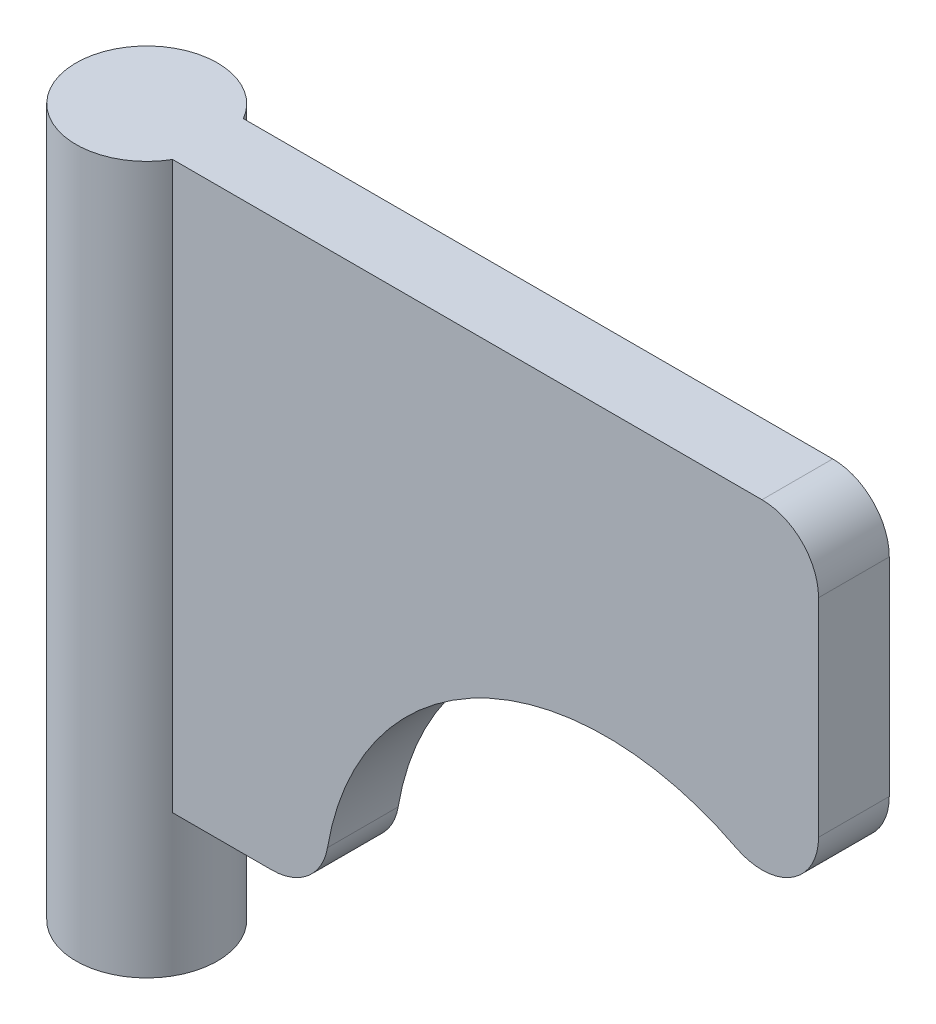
ISO-10303-21;
HEADER;
FILE_DESCRIPTION(('STEP AP214'),'2;1');
FILE_NAME('part.step','',(''),(''),'','','');
FILE_SCHEMA(('AUTOMOTIVE_DESIGN { 1 0 10303 214 1 1 1 1 }'));
ENDSEC;
DATA;
#1=APPLICATION_CONTEXT('core data for automotive mechanical design processes');
#2=APPLICATION_PROTOCOL_DEFINITION('international standard','automotive_design',2000,#1);
#3=PRODUCT_CONTEXT('',#1,'mechanical');
#4=PRODUCT('Part','Part','',(#3));
#5=PRODUCT_RELATED_PRODUCT_CATEGORY('part','',(#4));
#6=PRODUCT_DEFINITION_FORMATION('','',#4);
#7=PRODUCT_DEFINITION_CONTEXT('part definition',#1,'design');
#8=PRODUCT_DEFINITION('design','',#6,#7);
#9=PRODUCT_DEFINITION_SHAPE('','',#8);
#10=(LENGTH_UNIT() NAMED_UNIT(*) SI_UNIT(.MILLI.,.METRE.));
#11=(NAMED_UNIT(*) PLANE_ANGLE_UNIT() SI_UNIT($,.RADIAN.));
#12=(NAMED_UNIT(*) SI_UNIT($,.STERADIAN.) SOLID_ANGLE_UNIT());
#13=UNCERTAINTY_MEASURE_WITH_UNIT(LENGTH_MEASURE(1.E-05),#10,'distance_accuracy_value','');
#14=(GEOMETRIC_REPRESENTATION_CONTEXT(3) GLOBAL_UNCERTAINTY_ASSIGNED_CONTEXT((#13)) GLOBAL_UNIT_ASSIGNED_CONTEXT((#10,
#11,#12)) REPRESENTATION_CONTEXT('',''));
#15=CARTESIAN_POINT('',(0.,0.,0.));
#16=DIRECTION('',(0.,0.,1.));
#17=DIRECTION('',(1.,0.,0.));
#18=AXIS2_PLACEMENT_3D('',#15,#16,#17);
#19=CARTESIAN_POINT('',(0.,0.,3.175));
#20=DIRECTION('',(0.,1.,0.));
#21=DIRECTION('',(0.,0.,1.));
#22=AXIS2_PLACEMENT_3D('',#19,#20,#21);
#23=PLANE('',#22);
#24=DIRECTION('',(1.,0.,0.));
#25=VECTOR('',#24,1.);
#26=CARTESIAN_POINT('',(0.,0.,3.175));
#27=LINE('',#26,#25);
#28=CARTESIAN_POINT('',(2.74963065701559,0.,3.175));
#29=VERTEX_POINT('',#28);
#30=CARTESIAN_POINT('',(7.19815735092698,0.,3.175));
#31=VERTEX_POINT('',#30);
#32=EDGE_CURVE('E87',#29,#31,#27,.T.);
#33=ORIENTED_EDGE('',*,*,#32,.F.);
#34=CARTESIAN_POINT('',(0.,0.,1.5875));
#35=DIRECTION('',(0.,1.,0.));
#36=DIRECTION('',(0.,0.,1.));
#37=AXIS2_PLACEMENT_3D('',#34,#35,#36);
#38=CIRCLE('',#37,3.175);
#39=CARTESIAN_POINT('',(2.74963065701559,0.,0.));
#40=VERTEX_POINT('',#39);
#41=EDGE_CURVE('E161',#29,#40,#38,.T.);
#42=ORIENTED_EDGE('',*,*,#41,.T.);
#43=DIRECTION('',(1.,0.,0.));
#44=VECTOR('',#43,1.);
#45=CARTESIAN_POINT('',(0.,0.,0.));
#46=LINE('',#45,#44);
#47=CARTESIAN_POINT('',(7.19815735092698,0.,0.));
#48=VERTEX_POINT('',#47);
#49=EDGE_CURVE('E123',#40,#48,#46,.T.);
#50=ORIENTED_EDGE('',*,*,#49,.T.);
#51=DIRECTION('',(0.,0.,-1.));
#52=VECTOR('',#51,1.);
#53=CARTESIAN_POINT('',(7.19815735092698,0.,3.175));
#54=LINE('',#53,#52);
#55=EDGE_CURVE('E41',#31,#48,#54,.T.);
#56=ORIENTED_EDGE('',*,*,#55,.F.);
#57=EDGE_LOOP('',(#33,#42,#50,#56));
#58=FACE_BOUND('',#57,.T.);
#59=ADVANCED_FACE('F33',(#58),#23,.F.);
#60=CARTESIAN_POINT('',(7.19815735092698,2.54,3.175));
#61=DIRECTION('',(0.,0.,-1.));
#62=DIRECTION('',(-1.,0.,0.));
#63=AXIS2_PLACEMENT_3D('',#60,#61,#62);
#64=CYLINDRICAL_SURFACE('',#63,2.54);
#65=CARTESIAN_POINT('',(7.19815735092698,2.54,0.));
#66=DIRECTION('',(0.,0.,1.));
#67=DIRECTION('',(-1.,0.,0.));
#68=AXIS2_PLACEMENT_3D('',#65,#66,#67);
#69=CIRCLE('',#68,2.54);
#70=CARTESIAN_POINT('',(9.70263112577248,2.11666666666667,0.));
#71=VERTEX_POINT('',#70);
#72=EDGE_CURVE('E125',#48,#71,#69,.T.);
#73=ORIENTED_EDGE('',*,*,#72,.T.);
#74=DIRECTION('',(0.,0.,-1.));
#75=VECTOR('',#74,1.);
#76=CARTESIAN_POINT('',(9.70263112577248,2.11666666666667,3.175));
#77=LINE('',#76,#75);
#78=CARTESIAN_POINT('',(9.70263112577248,2.11666666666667,3.175));
#79=VERTEX_POINT('',#78);
#80=EDGE_CURVE('E139',#79,#71,#77,.T.);
#81=ORIENTED_EDGE('',*,*,#80,.F.);
#82=CARTESIAN_POINT('',(7.19815735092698,2.54,3.175));
#83=DIRECTION('',(0.,0.,1.));
#84=DIRECTION('',(-1.,0.,0.));
#85=AXIS2_PLACEMENT_3D('',#82,#83,#84);
#86=CIRCLE('',#85,2.54);
#87=EDGE_CURVE('E147',#31,#79,#86,.T.);
#88=ORIENTED_EDGE('',*,*,#87,.F.);
#89=ORIENTED_EDGE('',*,*,#55,.T.);
#90=EDGE_LOOP('',(#73,#81,#88,#89));
#91=FACE_BOUND('',#90,.T.);
#92=ADVANCED_FACE('F145',(#91),#64,.T.);
#93=CARTESIAN_POINT('',(22.225,0.,3.175));
#94=DIRECTION('',(0.,0.,-1.));
#95=DIRECTION('',(-1.,0.,0.));
#96=AXIS2_PLACEMENT_3D('',#93,#94,#95);
#97=CYLINDRICAL_SURFACE('',#96,12.7);
#98=CARTESIAN_POINT('',(22.225,0.,0.));
#99=DIRECTION('',(0.,0.,-1.));
#100=DIRECTION('',(1.,0.,0.));
#101=AXIS2_PLACEMENT_3D('',#98,#99,#100);
#102=CIRCLE('',#101,12.7);
#103=CARTESIAN_POINT('',(28.0458333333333,11.2875107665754,0.));
#104=VERTEX_POINT('',#103);
#105=EDGE_CURVE('E128',#71,#104,#102,.T.);
#106=ORIENTED_EDGE('',*,*,#105,.T.);
#107=DIRECTION('',(0.,0.,-1.));
#108=VECTOR('',#107,1.);
#109=CARTESIAN_POINT('',(28.0458333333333,11.2875107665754,3.175));
#110=LINE('',#109,#108);
#111=CARTESIAN_POINT('',(28.0458333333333,11.2875107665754,3.175));
#112=VERTEX_POINT('',#111);
#113=EDGE_CURVE('E112',#112,#104,#110,.T.);
#114=ORIENTED_EDGE('',*,*,#113,.F.);
#115=CARTESIAN_POINT('',(22.225,0.,3.175));
#116=DIRECTION('',(0.,0.,-1.));
#117=DIRECTION('',(1.,0.,0.));
#118=AXIS2_PLACEMENT_3D('',#115,#116,#117);
#119=CIRCLE('',#118,12.7);
#120=EDGE_CURVE('E103',#79,#112,#119,.T.);
#121=ORIENTED_EDGE('',*,*,#120,.F.);
#122=ORIENTED_EDGE('',*,*,#80,.T.);
#123=EDGE_LOOP('',(#106,#114,#121,#122));
#124=FACE_BOUND('',#123,.T.);
#125=ADVANCED_FACE('F156',(#124),#97,.F.);
#126=CARTESIAN_POINT('',(29.21,13.5450129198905,3.175));
#127=DIRECTION('',(0.,0.,-1.));
#128=DIRECTION('',(-1.,0.,0.));
#129=AXIS2_PLACEMENT_3D('',#126,#127,#128);
#130=CYLINDRICAL_SURFACE('',#129,2.54);
#131=CARTESIAN_POINT('',(29.21,13.5450129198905,0.));
#132=DIRECTION('',(0.,0.,1.));
#133=DIRECTION('',(1.,0.,0.));
#134=AXIS2_PLACEMENT_3D('',#131,#132,#133);
#135=CIRCLE('',#134,2.54);
#136=CARTESIAN_POINT('',(31.75,13.5450129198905,0.));
#137=VERTEX_POINT('',#136);
#138=EDGE_CURVE('E111',#104,#137,#135,.T.);
#139=ORIENTED_EDGE('',*,*,#138,.T.);
#140=DIRECTION('',(0.,0.,-1.));
#141=VECTOR('',#140,1.);
#142=CARTESIAN_POINT('',(31.75,13.5450129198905,3.175));
#143=LINE('',#142,#141);
#144=CARTESIAN_POINT('',(31.75,13.5450129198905,3.175));
#145=VERTEX_POINT('',#144);
#146=EDGE_CURVE('E108',#145,#137,#143,.T.);
#147=ORIENTED_EDGE('',*,*,#146,.F.);
#148=CARTESIAN_POINT('',(29.21,13.5450129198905,3.175));
#149=DIRECTION('',(0.,0.,1.));
#150=DIRECTION('',(1.,0.,0.));
#151=AXIS2_PLACEMENT_3D('',#148,#149,#150);
#152=CIRCLE('',#151,2.54);
#153=EDGE_CURVE('E97',#112,#145,#152,.T.);
#154=ORIENTED_EDGE('',*,*,#153,.F.);
#155=ORIENTED_EDGE('',*,*,#113,.T.);
#156=EDGE_LOOP('',(#139,#147,#154,#155));
#157=FACE_BOUND('',#156,.T.);
#158=ADVANCED_FACE('F109',(#157),#130,.T.);
#159=CARTESIAN_POINT('',(31.75,13.5450129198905,3.175));
#160=DIRECTION('',(-1.,0.,0.));
#161=DIRECTION('',(0.,0.,1.));
#162=AXIS2_PLACEMENT_3D('',#159,#160,#161);
#163=PLANE('',#162);
#164=DIRECTION('',(0.,1.,0.));
#165=VECTOR('',#164,1.);
#166=CARTESIAN_POINT('',(31.75,13.5450129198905,0.));
#167=LINE('',#166,#165);
#168=CARTESIAN_POINT('',(31.75,22.86,0.));
#169=VERTEX_POINT('',#168);
#170=EDGE_CURVE('E73',#137,#169,#167,.T.);
#171=ORIENTED_EDGE('',*,*,#170,.T.);
#172=DIRECTION('',(0.,0.,-1.));
#173=VECTOR('',#172,1.);
#174=CARTESIAN_POINT('',(31.75,22.86,3.175));
#175=LINE('',#174,#173);
#176=CARTESIAN_POINT('',(31.75,22.86,3.175));
#177=VERTEX_POINT('',#176);
#178=EDGE_CURVE('E113',#177,#169,#175,.T.);
#179=ORIENTED_EDGE('',*,*,#178,.F.);
#180=DIRECTION('',(0.,1.,0.));
#181=VECTOR('',#180,1.);
#182=CARTESIAN_POINT('',(31.75,13.5450129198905,3.175));
#183=LINE('',#182,#181);
#184=EDGE_CURVE('E101',#145,#177,#183,.T.);
#185=ORIENTED_EDGE('',*,*,#184,.F.);
#186=ORIENTED_EDGE('',*,*,#146,.T.);
#187=EDGE_LOOP('',(#171,#179,#185,#186));
#188=FACE_BOUND('',#187,.T.);
#189=ADVANCED_FACE('F115',(#188),#163,.F.);
#190=CARTESIAN_POINT('',(29.21,22.86,3.175));
#191=DIRECTION('',(0.,0.,-1.));
#192=DIRECTION('',(-1.,0.,0.));
#193=AXIS2_PLACEMENT_3D('',#190,#191,#192);
#194=CYLINDRICAL_SURFACE('',#193,2.54);
#195=CARTESIAN_POINT('',(29.21,22.86,0.));
#196=DIRECTION('',(0.,0.,1.));
#197=DIRECTION('',(-1.,0.,0.));
#198=AXIS2_PLACEMENT_3D('',#195,#196,#197);
#199=CIRCLE('',#198,2.54);
#200=CARTESIAN_POINT('',(29.21,25.4,0.));
#201=VERTEX_POINT('',#200);
#202=EDGE_CURVE('E79',#169,#201,#199,.T.);
#203=ORIENTED_EDGE('',*,*,#202,.T.);
#204=DIRECTION('',(0.,0.,-1.));
#205=VECTOR('',#204,1.);
#206=CARTESIAN_POINT('',(29.21,25.4,3.175));
#207=LINE('',#206,#205);
#208=CARTESIAN_POINT('',(29.21,25.4,3.175));
#209=VERTEX_POINT('',#208);
#210=EDGE_CURVE('E122',#209,#201,#207,.T.);
#211=ORIENTED_EDGE('',*,*,#210,.F.);
#212=CARTESIAN_POINT('',(29.21,22.86,3.175));
#213=DIRECTION('',(0.,0.,1.));
#214=DIRECTION('',(-1.,0.,0.));
#215=AXIS2_PLACEMENT_3D('',#212,#213,#214);
#216=CIRCLE('',#215,2.54);
#217=EDGE_CURVE('E49',#177,#209,#216,.T.);
#218=ORIENTED_EDGE('',*,*,#217,.F.);
#219=ORIENTED_EDGE('',*,*,#178,.T.);
#220=EDGE_LOOP('',(#203,#211,#218,#219));
#221=FACE_BOUND('',#220,.T.);
#222=ADVANCED_FACE('F201',(#221),#194,.T.);
#223=CARTESIAN_POINT('',(0.,25.4,3.175));
#224=DIRECTION('',(0.,-1.,0.));
#225=DIRECTION('',(0.,0.,-1.));
#226=AXIS2_PLACEMENT_3D('',#223,#224,#225);
#227=PLANE('',#226);
#228=DIRECTION('',(-1.,0.,0.));
#229=VECTOR('',#228,1.);
#230=CARTESIAN_POINT('',(0.,25.4,0.));
#231=LINE('',#230,#229);
#232=CARTESIAN_POINT('',(2.74963065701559,25.4,0.));
#233=VERTEX_POINT('',#232);
#234=EDGE_CURVE('E133',#201,#233,#231,.T.);
#235=ORIENTED_EDGE('',*,*,#234,.T.);
#236=CARTESIAN_POINT('',(0.,25.4,1.5875));
#237=DIRECTION('',(0.,-1.,0.));
#238=DIRECTION('',(0.,0.,-1.));
#239=AXIS2_PLACEMENT_3D('',#236,#237,#238);
#240=CIRCLE('',#239,3.175);
#241=CARTESIAN_POINT('',(2.74963065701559,25.4,3.175));
#242=VERTEX_POINT('',#241);
#243=EDGE_CURVE('E164',#233,#242,#240,.F.);
#244=ORIENTED_EDGE('',*,*,#243,.T.);
#245=DIRECTION('',(-1.,0.,0.));
#246=VECTOR('',#245,1.);
#247=CARTESIAN_POINT('',(0.,25.4,3.175));
#248=LINE('',#247,#246);
#249=EDGE_CURVE('E117',#209,#242,#248,.T.);
#250=ORIENTED_EDGE('',*,*,#249,.F.);
#251=ORIENTED_EDGE('',*,*,#210,.T.);
#252=EDGE_LOOP('',(#235,#244,#250,#251));
#253=FACE_BOUND('',#252,.T.);
#254=ADVANCED_FACE('F185',(#253),#227,.F.);
#255=CARTESIAN_POINT('',(29.21,22.86,3.175));
#256=DIRECTION('',(0.,0.,-1.));
#257=DIRECTION('',(-1.,0.,0.));
#258=AXIS2_PLACEMENT_3D('',#255,#256,#257);
#259=PLANE('',#258);
#260=ORIENTED_EDGE('',*,*,#249,.T.);
#261=DIRECTION('',(0.,-1.,0.));
#262=VECTOR('',#261,1.);
#263=CARTESIAN_POINT('',(2.74963065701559,34.3802561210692,3.175));
#264=LINE('',#263,#262);
#265=EDGE_CURVE('E126',#242,#29,#264,.T.);
#266=ORIENTED_EDGE('',*,*,#265,.T.);
#267=ORIENTED_EDGE('',*,*,#32,.T.);
#268=ORIENTED_EDGE('',*,*,#87,.T.);
#269=ORIENTED_EDGE('',*,*,#120,.T.);
#270=ORIENTED_EDGE('',*,*,#153,.T.);
#271=ORIENTED_EDGE('',*,*,#184,.T.);
#272=ORIENTED_EDGE('',*,*,#217,.T.);
#273=EDGE_LOOP('',(#260,#266,#267,#268,#269,#270,#271,#272));
#274=FACE_BOUND('',#273,.T.);
#275=ADVANCED_FACE('F99',(#274),#259,.F.);
#276=CARTESIAN_POINT('',(29.21,22.86,0.));
#277=DIRECTION('',(0.,0.,-1.));
#278=DIRECTION('',(-1.,0.,0.));
#279=AXIS2_PLACEMENT_3D('',#276,#277,#278);
#280=PLANE('',#279);
#281=DIRECTION('',(0.,-1.,0.));
#282=VECTOR('',#281,1.);
#283=CARTESIAN_POINT('',(2.74963065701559,34.3802561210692,0.));
#284=LINE('',#283,#282);
#285=EDGE_CURVE('E11',#233,#40,#284,.T.);
#286=ORIENTED_EDGE('',*,*,#285,.F.);
#287=ORIENTED_EDGE('',*,*,#234,.F.);
#288=ORIENTED_EDGE('',*,*,#202,.F.);
#289=ORIENTED_EDGE('',*,*,#170,.F.);
#290=ORIENTED_EDGE('',*,*,#138,.F.);
#291=ORIENTED_EDGE('',*,*,#105,.F.);
#292=ORIENTED_EDGE('',*,*,#72,.F.);
#293=ORIENTED_EDGE('',*,*,#49,.F.);
#294=EDGE_LOOP('',(#286,#287,#288,#289,#290,#291,#292,#293));
#295=FACE_BOUND('',#294,.T.);
#296=ADVANCED_FACE('F153',(#295),#280,.T.);
#297=CARTESIAN_POINT('',(0.,34.3802561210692,1.5875));
#298=DIRECTION('',(0.,-1.,0.));
#299=DIRECTION('',(0.,0.,-1.));
#300=AXIS2_PLACEMENT_3D('',#297,#298,#299);
#301=CYLINDRICAL_SURFACE('',#300,3.175);
#302=CARTESIAN_POINT('',(0.,-6.35,1.5875));
#303=DIRECTION('',(0.,-1.,0.));
#304=DIRECTION('',(0.,0.,-1.));
#305=AXIS2_PLACEMENT_3D('',#302,#303,#304);
#306=CIRCLE('',#305,3.175);
#307=CARTESIAN_POINT('',(0.,-6.35,-1.5875));
#308=VERTEX_POINT('',#307);
#309=EDGE_CURVE('E167',#308,#308,#306,.T.);
#310=ORIENTED_EDGE('',*,*,#309,.F.);
#311=EDGE_LOOP('',(#310));
#312=FACE_BOUND('',#311,.T.);
#313=ORIENTED_EDGE('',*,*,#265,.F.);
#314=ORIENTED_EDGE('',*,*,#243,.F.);
#315=ORIENTED_EDGE('',*,*,#285,.T.);
#316=ORIENTED_EDGE('',*,*,#41,.F.);
#317=EDGE_LOOP('',(#313,#314,#315,#316));
#318=FACE_BOUND('',#317,.T.);
#319=ADVANCED_FACE('F173',(#312,#318),#301,.T.);
#320=CARTESIAN_POINT('',(0.,-6.35,1.5875));
#321=DIRECTION('',(0.,-1.,0.));
#322=DIRECTION('',(0.,0.,-1.));
#323=AXIS2_PLACEMENT_3D('',#320,#321,#322);
#324=PLANE('',#323);
#325=ORIENTED_EDGE('',*,*,#309,.T.);
#326=EDGE_LOOP('',(#325));
#327=FACE_BOUND('',#326,.T.);
#328=ADVANCED_FACE('F171',(#327),#324,.T.);
#329=CLOSED_SHELL('',(#59,#92,#125,#158,#189,#222,#254,#275,#296,#319,#328));
#330=MANIFOLD_SOLID_BREP('B2',#329);
#331=ADVANCED_BREP_SHAPE_REPRESENTATION('',(#18,#330),#14);
#332=SHAPE_DEFINITION_REPRESENTATION(#9,#331);
ENDSEC;
END-ISO-10303-21;
